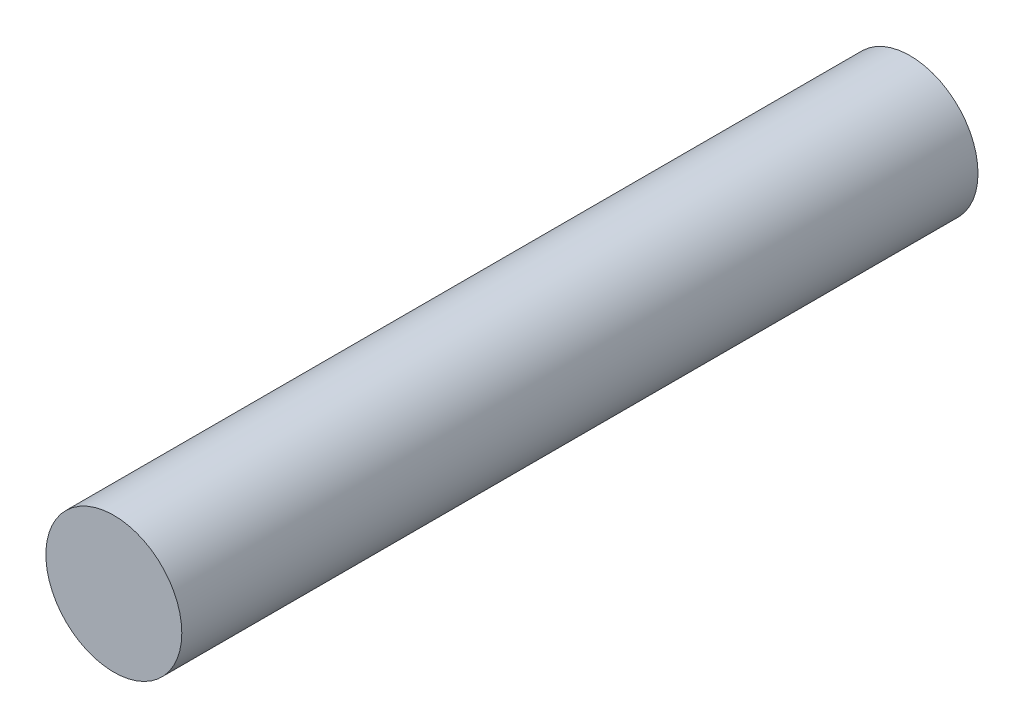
ISO-10303-21;
HEADER;
FILE_DESCRIPTION(('STEP AP214'),'2;1');
FILE_NAME('part.step','',(''),(''),'','','');
FILE_SCHEMA(('AUTOMOTIVE_DESIGN { 1 0 10303 214 1 1 1 1 }'));
ENDSEC;
DATA;
#1=APPLICATION_CONTEXT('core data for automotive mechanical design processes');
#2=APPLICATION_PROTOCOL_DEFINITION('international standard','automotive_design',2000,#1);
#3=PRODUCT_CONTEXT('',#1,'mechanical');
#4=PRODUCT('Part','Part','',(#3));
#5=PRODUCT_RELATED_PRODUCT_CATEGORY('part','',(#4));
#6=PRODUCT_DEFINITION_FORMATION('','',#4);
#7=PRODUCT_DEFINITION_CONTEXT('part definition',#1,'design');
#8=PRODUCT_DEFINITION('design','',#6,#7);
#9=PRODUCT_DEFINITION_SHAPE('','',#8);
#10=(LENGTH_UNIT() NAMED_UNIT(*) SI_UNIT(.MILLI.,.METRE.));
#11=(NAMED_UNIT(*) PLANE_ANGLE_UNIT() SI_UNIT($,.RADIAN.));
#12=(NAMED_UNIT(*) SI_UNIT($,.STERADIAN.) SOLID_ANGLE_UNIT());
#13=UNCERTAINTY_MEASURE_WITH_UNIT(LENGTH_MEASURE(1.E-05),#10,'distance_accuracy_value','');
#14=(GEOMETRIC_REPRESENTATION_CONTEXT(3) GLOBAL_UNCERTAINTY_ASSIGNED_CONTEXT((#13)) GLOBAL_UNIT_ASSIGNED_CONTEXT((#10,
#11,#12)) REPRESENTATION_CONTEXT('',''));
#15=CARTESIAN_POINT('',(0.,0.,0.));
#16=DIRECTION('',(0.,0.,1.));
#17=DIRECTION('',(1.,0.,0.));
#18=AXIS2_PLACEMENT_3D('',#15,#16,#17);
#19=CARTESIAN_POINT('',(0.,0.,82.));
#20=DIRECTION('',(0.,0.,-1.));
#21=DIRECTION('',(-1.,0.,0.));
#22=AXIS2_PLACEMENT_3D('',#19,#20,#21);
#23=CYLINDRICAL_SURFACE('',#22,7.);
#24=CARTESIAN_POINT('',(0.,0.,82.));
#25=DIRECTION('',(0.,0.,1.));
#26=DIRECTION('',(1.,0.,0.));
#27=AXIS2_PLACEMENT_3D('',#24,#25,#26);
#28=CIRCLE('',#27,7.);
#29=CARTESIAN_POINT('',(7.,0.,82.));
#30=VERTEX_POINT('',#29);
#31=EDGE_CURVE('E10',#30,#30,#28,.T.);
#32=ORIENTED_EDGE('',*,*,#31,.F.);
#33=EDGE_LOOP('',(#32));
#34=FACE_BOUND('',#33,.T.);
#35=CARTESIAN_POINT('',(0.,0.,0.));
#36=DIRECTION('',(0.,0.,1.));
#37=DIRECTION('',(1.,0.,0.));
#38=AXIS2_PLACEMENT_3D('',#35,#36,#37);
#39=CIRCLE('',#38,7.);
#40=CARTESIAN_POINT('',(7.,0.,0.));
#41=VERTEX_POINT('',#40);
#42=EDGE_CURVE('E34',#41,#41,#39,.T.);
#43=ORIENTED_EDGE('',*,*,#42,.T.);
#44=EDGE_LOOP('',(#43));
#45=FACE_BOUND('',#44,.T.);
#46=ADVANCED_FACE('F31',(#34,#45),#23,.T.);
#47=CARTESIAN_POINT('',(0.,0.,82.));
#48=DIRECTION('',(0.,0.,1.));
#49=DIRECTION('',(1.,0.,0.));
#50=AXIS2_PLACEMENT_3D('',#47,#48,#49);
#51=PLANE('',#50);
#52=ORIENTED_EDGE('',*,*,#31,.T.);
#53=EDGE_LOOP('',(#52));
#54=FACE_BOUND('',#53,.T.);
#55=ADVANCED_FACE('F46',(#54),#51,.T.);
#56=CARTESIAN_POINT('',(0.,0.,0.));
#57=DIRECTION('',(0.,0.,1.));
#58=DIRECTION('',(1.,0.,0.));
#59=AXIS2_PLACEMENT_3D('',#56,#57,#58);
#60=PLANE('',#59);
#61=ORIENTED_EDGE('',*,*,#42,.F.);
#62=EDGE_LOOP('',(#61));
#63=FACE_BOUND('',#62,.T.);
#64=ADVANCED_FACE('F44',(#63),#60,.F.);
#65=CLOSED_SHELL('',(#46,#55,#64));
#66=MANIFOLD_SOLID_BREP('B2',#65);
#67=ADVANCED_BREP_SHAPE_REPRESENTATION('',(#18,#66),#14);
#68=SHAPE_DEFINITION_REPRESENTATION(#9,#67);
ENDSEC;
END-ISO-10303-21;
